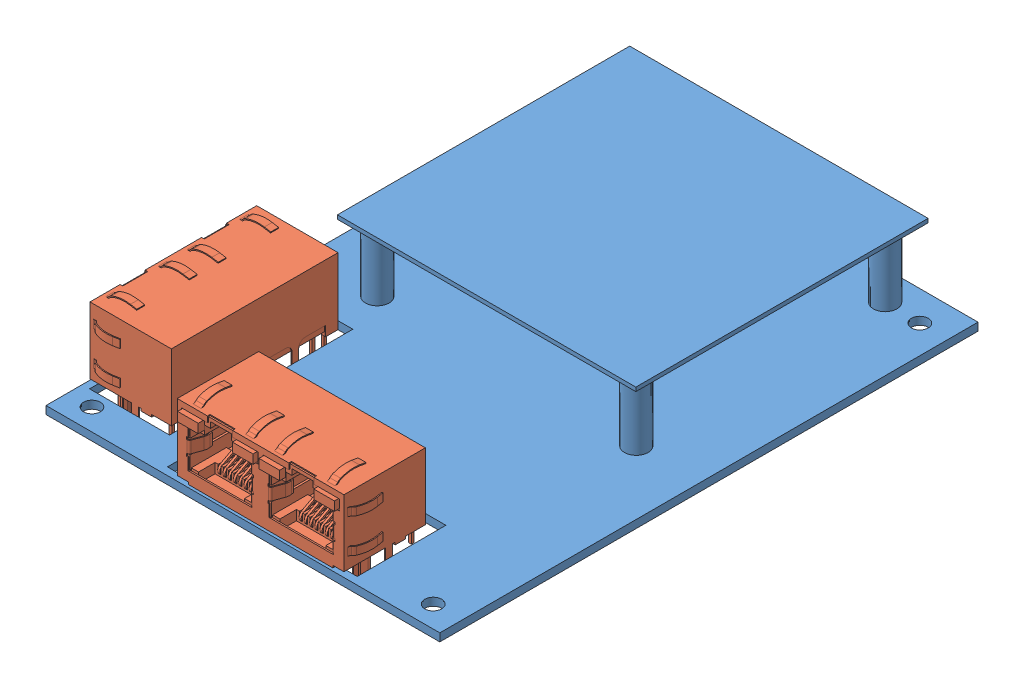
SolidWorks assembly Assembly, EOM-104 Carrier.SLDASM, configuration Default (file format 11000). Lengths in mm.
Overall size (76.92 18.72 104.6).
3 component instances, 2 part files, 6 mates.
Components (placement in the parent):
- EOM-104 Carrier Board-1: EOM-104 Carrier Board.SLDPRT [Default] at origin size (76.2 14.99 104.14)
- c-6116353-4-d-3d-1: c-6116353-4-d-3d.SLDPRT [Default] at (2.921 8.2169 51.562) size (34.65 18.72 16.72)
- c-6116353-4-d-3d-2: c-6116353-4-d-3d.SLDPRT [Default] at (-37.846 8.2169 27.686) x (0 0 1) z (-1 0 0) size (34.65 18.72 16.72)
Mates (geometry in assembly coordinates):
- Coincident2: coincident: plane of EOM-104 Carrier Board-1 through (0 1.524 0) normal (0 1 0); plane of c-6116353-4-d-3d-1 through (17.78 1.524 41.656) normal (0 -1 0)
- Distance1: distance = 0.508 mm: plane of EOM-104 Carrier Board-1 through (-38.1 1.524 52.07) normal (0 0 1); plane of c-6116353-4-d-3d-1 through (-13.208 14.8844 51.562) normal (0 0 1)
- Distance2: distance = 19.05 mm: plane of EOM-104 Carrier Board-1 through (38.1 1.524 -52.07) normal (1 0 0); plane of c-6116353-4-d-3d-1 through (19.05 8.2169 51.562) normal (1 0 0)
- Coincident5: coincident: plane of EOM-104 Carrier Board-1 through (0 1.524 0) normal (0 1 0); plane of c-6116353-4-d-3d-2 through (-27.94 1.524 42.545) normal (0 -1 0)
- Distance4: distance = 0.254 mm: plane of c-6116353-4-d-3d-2 through (-37.846 14.8844 11.557) normal (-1 0 0); plane of EOM-104 Carrier Board-1 through (-38.1 1.524 -52.07) normal (-1 0 0)
- Distance5: distance = 8.255 mm: plane of c-6116353-4-d-3d-2 through (-37.846 8.2169 43.815) normal (0 0 1); plane of EOM-104 Carrier Board-1 through (-38.1 1.524 52.07) normal (0 0 1)
